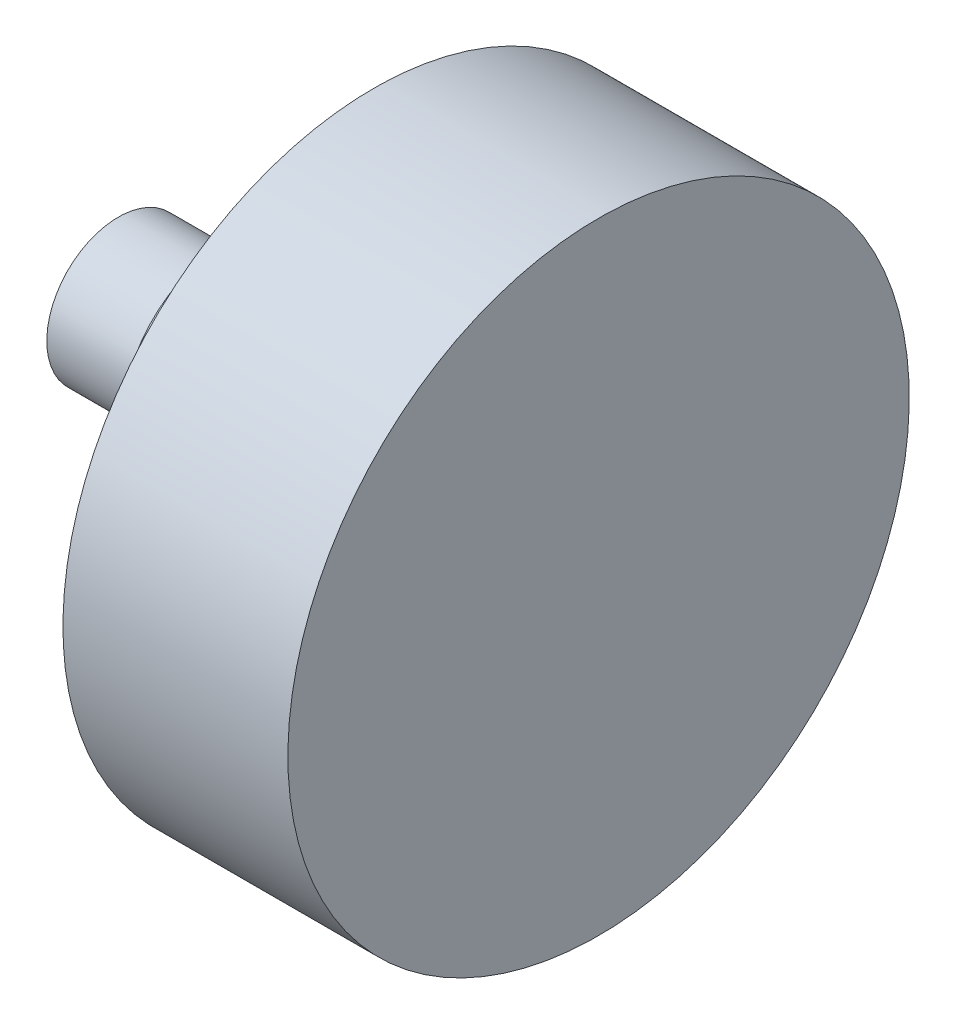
ISO-10303-21;
HEADER;
FILE_DESCRIPTION(('STEP AP214'),'2;1');
FILE_NAME('part.step','',(''),(''),'','','');
FILE_SCHEMA(('AUTOMOTIVE_DESIGN { 1 0 10303 214 1 1 1 1 }'));
ENDSEC;
DATA;
#1=APPLICATION_CONTEXT('core data for automotive mechanical design processes');
#2=APPLICATION_PROTOCOL_DEFINITION('international standard','automotive_design',2000,#1);
#3=PRODUCT_CONTEXT('',#1,'mechanical');
#4=PRODUCT('Part','Part','',(#3));
#5=PRODUCT_RELATED_PRODUCT_CATEGORY('part','',(#4));
#6=PRODUCT_DEFINITION_FORMATION('','',#4);
#7=PRODUCT_DEFINITION_CONTEXT('part definition',#1,'design');
#8=PRODUCT_DEFINITION('design','',#6,#7);
#9=PRODUCT_DEFINITION_SHAPE('','',#8);
#10=(LENGTH_UNIT() NAMED_UNIT(*) SI_UNIT(.MILLI.,.METRE.));
#11=(NAMED_UNIT(*) PLANE_ANGLE_UNIT() SI_UNIT($,.RADIAN.));
#12=(NAMED_UNIT(*) SI_UNIT($,.STERADIAN.) SOLID_ANGLE_UNIT());
#13=UNCERTAINTY_MEASURE_WITH_UNIT(LENGTH_MEASURE(1.E-05),#10,'distance_accuracy_value','');
#14=(GEOMETRIC_REPRESENTATION_CONTEXT(3) GLOBAL_UNCERTAINTY_ASSIGNED_CONTEXT((#13)) GLOBAL_UNIT_ASSIGNED_CONTEXT((#10,
#11,#12)) REPRESENTATION_CONTEXT('',''));
#15=CARTESIAN_POINT('',(0.,0.,0.));
#16=DIRECTION('',(0.,0.,1.));
#17=DIRECTION('',(1.,0.,0.));
#18=AXIS2_PLACEMENT_3D('',#15,#16,#17);
#19=CARTESIAN_POINT('',(68.7599999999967,451.664633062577,-179.169167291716));
#20=DIRECTION('',(-1.,0.,0.));
#21=DIRECTION('',(0.,1.,0.));
#22=AXIS2_PLACEMENT_3D('',#19,#20,#21);
#23=CYLINDRICAL_SURFACE('',#22,35.);
#24=CARTESIAN_POINT('',(68.7599999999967,451.664633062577,-179.169167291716));
#25=DIRECTION('',(1.,0.,0.));
#26=DIRECTION('',(0.,1.,0.));
#27=AXIS2_PLACEMENT_3D('',#24,#25,#26);
#28=CIRCLE('',#27,35.);
#29=CARTESIAN_POINT('',(68.7599999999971,430.044050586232,-206.692801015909));
#30=VERTEX_POINT('',#29);
#31=EDGE_CURVE('E11',#30,#30,#28,.T.);
#32=ORIENTED_EDGE('',*,*,#31,.T.);
#33=EDGE_LOOP('',(#32));
#34=FACE_BOUND('',#33,.T.);
#35=CARTESIAN_POINT('',(94.0999999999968,451.664633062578,-179.169167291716));
#36=DIRECTION('',(-1.,0.,0.));
#37=DIRECTION('',(0.,1.,0.));
#38=AXIS2_PLACEMENT_3D('',#35,#36,#37);
#39=CIRCLE('',#38,35.);
#40=CARTESIAN_POINT('',(94.0999999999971,430.044050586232,-206.692801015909));
#41=VERTEX_POINT('',#40);
#42=EDGE_CURVE('E28',#41,#41,#39,.T.);
#43=ORIENTED_EDGE('',*,*,#42,.T.);
#44=EDGE_LOOP('',(#43));
#45=FACE_BOUND('',#44,.T.);
#46=ADVANCED_FACE('F17',(#34,#45),#23,.T.);
#47=CARTESIAN_POINT('',(51.9899999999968,463.164633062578,-179.169167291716));
#48=DIRECTION('',(-1.,0.,0.));
#49=DIRECTION('',(0.,0.,-1.));
#50=AXIS2_PLACEMENT_3D('',#47,#48,#49);
#51=PLANE('',#50);
#52=CARTESIAN_POINT('',(51.9899999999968,451.664633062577,-179.169167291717));
#53=DIRECTION('',(-1.,0.,0.));
#54=DIRECTION('',(0.,1.,0.));
#55=AXIS2_PLACEMENT_3D('',#52,#53,#54);
#56=CIRCLE('',#55,11.5);
#57=CARTESIAN_POINT('',(51.9899999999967,442.141009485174,-172.723192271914));
#58=VERTEX_POINT('',#57);
#59=EDGE_CURVE('E45',#58,#58,#56,.T.);
#60=ORIENTED_EDGE('',*,*,#59,.T.);
#61=EDGE_LOOP('',(#60));
#62=FACE_BOUND('',#61,.T.);
#63=CARTESIAN_POINT('',(51.9899999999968,451.664633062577,-179.169167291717));
#64=DIRECTION('',(-1.,0.,0.));
#65=DIRECTION('',(0.,1.,0.));
#66=AXIS2_PLACEMENT_3D('',#63,#64,#65);
#67=CIRCLE('',#66,8.05999999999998);
#68=CARTESIAN_POINT('',(51.9899999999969,443.604633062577,-179.169167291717));
#69=VERTEX_POINT('',#68);
#70=EDGE_CURVE('E49',#69,#69,#67,.T.);
#71=ORIENTED_EDGE('',*,*,#70,.F.);
#72=EDGE_LOOP('',(#71));
#73=FACE_BOUND('',#72,.T.);
#74=ADVANCED_FACE('F88',(#62,#73),#51,.T.);
#75=CARTESIAN_POINT('',(39.9999999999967,451.664633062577,-179.169167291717));
#76=DIRECTION('',(-1.,0.,0.));
#77=DIRECTION('',(0.,1.,0.));
#78=AXIS2_PLACEMENT_3D('',#75,#76,#77);
#79=CYLINDRICAL_SURFACE('',#78,11.5);
#80=CARTESIAN_POINT('',(68.7599999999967,451.664633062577,-179.169167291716));
#81=DIRECTION('',(-1.,0.,0.));
#82=DIRECTION('',(0.,1.,0.));
#83=AXIS2_PLACEMENT_3D('',#80,#81,#82);
#84=CIRCLE('',#83,11.5);
#85=CARTESIAN_POINT('',(68.7599999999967,442.141009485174,-172.723192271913));
#86=VERTEX_POINT('',#85);
#87=EDGE_CURVE('E21',#86,#86,#84,.T.);
#88=ORIENTED_EDGE('',*,*,#87,.T.);
#89=EDGE_LOOP('',(#88));
#90=FACE_BOUND('',#89,.T.);
#91=ORIENTED_EDGE('',*,*,#59,.F.);
#92=EDGE_LOOP('',(#91));
#93=FACE_BOUND('',#92,.T.);
#94=ADVANCED_FACE('F19',(#90,#93),#79,.T.);
#95=CARTESIAN_POINT('',(39.9999999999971,631.541009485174,-206.692801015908));
#96=DIRECTION('',(1.,0.,0.));
#97=DIRECTION('',(0.,1.,0.));
#98=AXIS2_PLACEMENT_3D('',#95,#96,#97);
#99=PLANE('',#98);
#100=CARTESIAN_POINT('',(39.9999999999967,451.664633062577,-179.169167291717));
#101=DIRECTION('',(1.,0.,0.));
#102=DIRECTION('',(0.,1.,0.));
#103=AXIS2_PLACEMENT_3D('',#100,#101,#102);
#104=CIRCLE('',#103,8.05999999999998);
#105=CARTESIAN_POINT('',(39.9999999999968,443.604633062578,-179.169167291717));
#106=VERTEX_POINT('',#105);
#107=EDGE_CURVE('E56',#106,#106,#104,.T.);
#108=ORIENTED_EDGE('',*,*,#107,.F.);
#109=EDGE_LOOP('',(#108));
#110=FACE_BOUND('',#109,.T.);
#111=ADVANCED_FACE('F84',(#110),#99,.F.);
#112=CARTESIAN_POINT('',(68.7599999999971,631.541009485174,-206.692801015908));
#113=DIRECTION('',(1.,0.,0.));
#114=DIRECTION('',(0.,1.,0.));
#115=AXIS2_PLACEMENT_3D('',#112,#113,#114);
#116=PLANE('',#115);
#117=ORIENTED_EDGE('',*,*,#31,.F.);
#118=EDGE_LOOP('',(#117));
#119=FACE_BOUND('',#118,.T.);
#120=ORIENTED_EDGE('',*,*,#87,.F.);
#121=EDGE_LOOP('',(#120));
#122=FACE_BOUND('',#121,.T.);
#123=ADVANCED_FACE('F53',(#119,#122),#116,.F.);
#124=CARTESIAN_POINT('',(94.0999999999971,631.541009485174,-206.692801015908));
#125=DIRECTION('',(1.,0.,0.));
#126=DIRECTION('',(0.,1.,0.));
#127=AXIS2_PLACEMENT_3D('',#124,#125,#126);
#128=PLANE('',#127);
#129=ORIENTED_EDGE('',*,*,#42,.F.);
#130=EDGE_LOOP('',(#129));
#131=FACE_BOUND('',#130,.T.);
#132=ADVANCED_FACE('F74',(#131),#128,.T.);
#133=CARTESIAN_POINT('',(39.9999999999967,451.664633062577,-179.169167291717));
#134=DIRECTION('',(-1.,0.,0.));
#135=DIRECTION('',(0.,1.,0.));
#136=AXIS2_PLACEMENT_3D('',#133,#134,#135);
#137=CYLINDRICAL_SURFACE('',#136,8.05999999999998);
#138=ORIENTED_EDGE('',*,*,#107,.T.);
#139=EDGE_LOOP('',(#138));
#140=FACE_BOUND('',#139,.T.);
#141=ORIENTED_EDGE('',*,*,#70,.T.);
#142=EDGE_LOOP('',(#141));
#143=FACE_BOUND('',#142,.T.);
#144=ADVANCED_FACE('F76',(#140,#143),#137,.T.);
#145=CLOSED_SHELL('',(#46,#74,#94,#111,#123,#132,#144));
#146=MANIFOLD_SOLID_BREP('B1',#145);
#147=ADVANCED_BREP_SHAPE_REPRESENTATION('',(#18,#146),#14);
#148=SHAPE_DEFINITION_REPRESENTATION(#9,#147);
ENDSEC;
END-ISO-10303-21;
